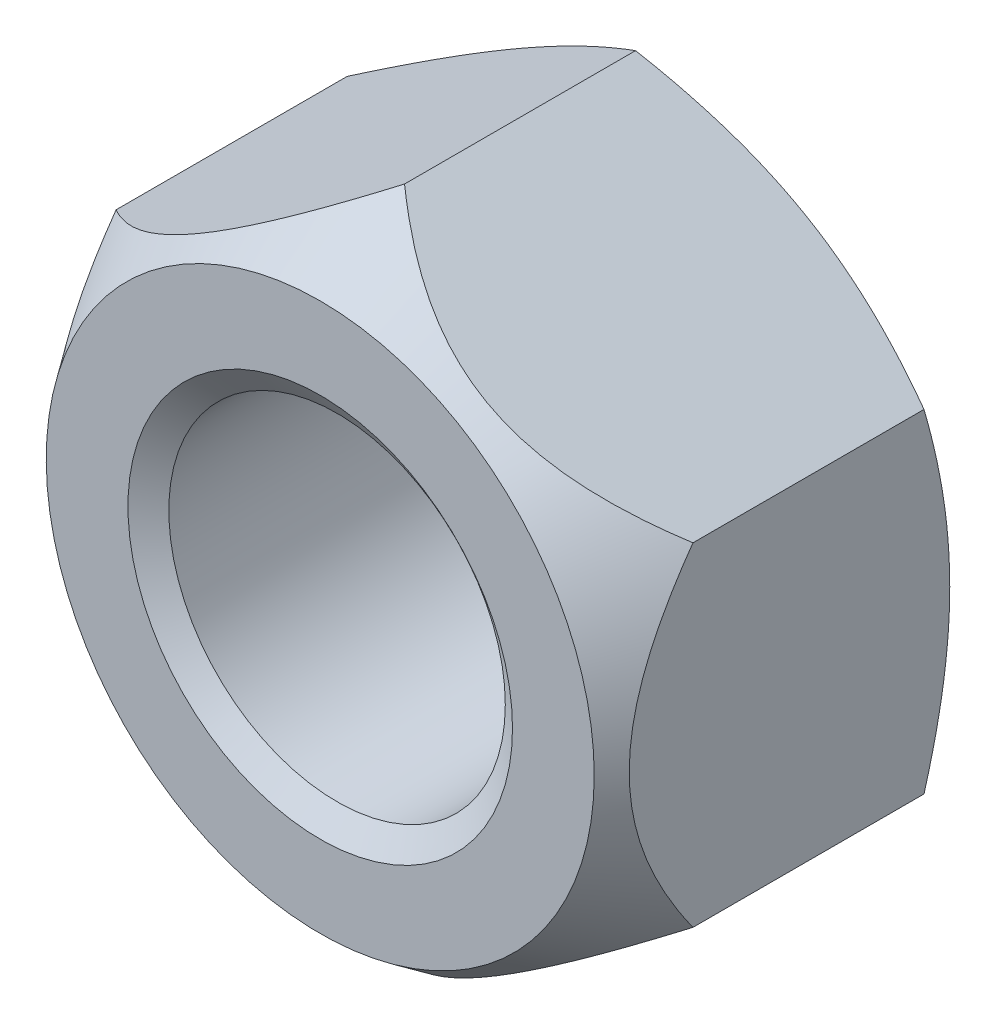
ISO-10303-21;
HEADER;
FILE_DESCRIPTION(('STEP AP214'),'2;1');
FILE_NAME('part.step','',(''),(''),'','','');
FILE_SCHEMA(('AUTOMOTIVE_DESIGN { 1 0 10303 214 1 1 1 1 }'));
ENDSEC;
DATA;
#1=APPLICATION_CONTEXT('core data for automotive mechanical design processes');
#2=APPLICATION_PROTOCOL_DEFINITION('international standard','automotive_design',2000,#1);
#3=PRODUCT_CONTEXT('',#1,'mechanical');
#4=PRODUCT('Part','Part','',(#3));
#5=PRODUCT_RELATED_PRODUCT_CATEGORY('part','',(#4));
#6=PRODUCT_DEFINITION_FORMATION('','',#4);
#7=PRODUCT_DEFINITION_CONTEXT('part definition',#1,'design');
#8=PRODUCT_DEFINITION('design','',#6,#7);
#9=PRODUCT_DEFINITION_SHAPE('','',#8);
#10=(LENGTH_UNIT() NAMED_UNIT(*) SI_UNIT(.MILLI.,.METRE.));
#11=(NAMED_UNIT(*) PLANE_ANGLE_UNIT() SI_UNIT($,.RADIAN.));
#12=(NAMED_UNIT(*) SI_UNIT($,.STERADIAN.) SOLID_ANGLE_UNIT());
#13=UNCERTAINTY_MEASURE_WITH_UNIT(LENGTH_MEASURE(1.E-05),#10,'distance_accuracy_value','');
#14=(GEOMETRIC_REPRESENTATION_CONTEXT(3) GLOBAL_UNCERTAINTY_ASSIGNED_CONTEXT((#13)) GLOBAL_UNIT_ASSIGNED_CONTEXT((#10,
#11,#12)) REPRESENTATION_CONTEXT('',''));
#15=CARTESIAN_POINT('',(0.,0.,0.));
#16=DIRECTION('',(0.,0.,1.));
#17=DIRECTION('',(1.,0.,0.));
#18=AXIS2_PLACEMENT_3D('',#15,#16,#17);
#19=CARTESIAN_POINT('',(0.,0.,-22.5298));
#20=DIRECTION('',(0.,0.,1.));
#21=DIRECTION('',(1.,0.,0.));
#22=AXIS2_PLACEMENT_3D('',#19,#20,#21);
#23=CYLINDRICAL_SURFACE('',#22,11.1125);
#24=CARTESIAN_POINT('',(0.,0.,-1.11157946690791));
#25=DIRECTION('',(0.,0.,1.));
#26=DIRECTION('',(1.,0.,0.));
#27=AXIS2_PLACEMENT_3D('',#24,#25,#26);
#28=CIRCLE('',#27,11.1125);
#29=CARTESIAN_POINT('',(11.1125,0.,-1.11157946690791));
#30=VERTEX_POINT('',#29);
#31=EDGE_CURVE('E152',#30,#30,#28,.F.);
#32=ORIENTED_EDGE('',*,*,#31,.F.);
#33=EDGE_LOOP('',(#32));
#34=FACE_BOUND('',#33,.T.);
#35=CARTESIAN_POINT('',(0.,0.,-21.3928205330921));
#36=DIRECTION('',(0.,0.,-1.));
#37=DIRECTION('',(-1.,0.,0.));
#38=AXIS2_PLACEMENT_3D('',#35,#36,#37);
#39=CIRCLE('',#38,11.1125);
#40=CARTESIAN_POINT('',(-11.1125,0.,-21.3928205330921));
#41=VERTEX_POINT('',#40);
#42=EDGE_CURVE('E46',#41,#41,#39,.F.);
#43=ORIENTED_EDGE('',*,*,#42,.F.);
#44=EDGE_LOOP('',(#43));
#45=FACE_BOUND('',#44,.T.);
#46=ADVANCED_FACE('F41',(#34,#45),#23,.F.);
#47=CARTESIAN_POINT('',(0.,21.9970452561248,-22.5298));
#48=DIRECTION('',(-0.500000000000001,0.866025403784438,0.));
#49=DIRECTION('',(-0.866025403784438,-0.500000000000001,0.));
#50=AXIS2_PLACEMENT_3D('',#47,#48,#49);
#51=PLANE('',#50);
#52=DIRECTION('',(0.,0.,1.));
#53=VECTOR('',#52,1.);
#54=CARTESIAN_POINT('',(-19.05,10.9985226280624,-22.5298));
#55=LINE('',#54,#53);
#56=CARTESIAN_POINT('',(-19.05,10.9985226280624,-20.8283226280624));
#57=VERTEX_POINT('',#56);
#58=CARTESIAN_POINT('',(-19.05,10.9985226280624,-5.56912778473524));
#59=VERTEX_POINT('',#58);
#60=EDGE_CURVE('E150',#57,#59,#55,.T.);
#61=ORIENTED_EDGE('',*,*,#60,.T.);
#62=CARTESIAN_POINT('',(-19.0502,10.9984071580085,-5.56929269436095));
#63=CARTESIAN_POINT('',(-18.8453662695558,11.1166679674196,-5.40041245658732));
#64=CARTESIAN_POINT('',(-18.6388597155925,11.2358945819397,-5.23420678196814));
#65=CARTESIAN_POINT('',(-18.2222319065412,11.4764347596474,-4.90783687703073));
#66=CARTESIAN_POINT('',(-18.0121098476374,11.5977487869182,-4.74767401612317));
#67=CARTESIAN_POINT('',(-17.5873475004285,11.8429854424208,-4.43362161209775));
#68=CARTESIAN_POINT('',(-17.3726941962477,11.9669155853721,-4.27975544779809));
#69=CARTESIAN_POINT('',(-16.9393892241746,12.2170843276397,-3.97977623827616));
#70=CARTESIAN_POINT('',(-16.7207377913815,12.3433227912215,-3.83366273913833));
#71=CARTESIAN_POINT('',(-16.0490977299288,12.7310943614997,-3.40234297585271));
#72=CARTESIAN_POINT('',(-15.5893666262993,12.9965202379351,-3.13087151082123));
#73=CARTESIAN_POINT('',(-14.6519085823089,13.5377618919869,-2.63436725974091));
#74=CARTESIAN_POINT('',(-14.1742069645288,13.8135630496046,-2.40927182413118));
#75=CARTESIAN_POINT('',(-13.3558001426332,14.2860704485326,-2.07908042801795));
#76=CARTESIAN_POINT('',(-13.019758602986,14.4800841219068,-1.95857631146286));
#77=CARTESIAN_POINT('',(-12.340467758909,14.8722728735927,-1.74816439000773));
#78=CARTESIAN_POINT('',(-11.99721829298,15.070448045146,-1.65825727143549));
#79=CARTESIAN_POINT('',(-11.3086235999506,15.4680083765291,-1.51311138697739));
#80=CARTESIAN_POINT('',(-10.9633302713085,15.66736357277,-1.45754754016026));
#81=CARTESIAN_POINT('',(-10.2698215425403,16.0677610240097,-1.3820479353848));
#82=CARTESIAN_POINT('',(-9.92160634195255,16.2688031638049,-1.36210976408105));
#83=CARTESIAN_POINT('',(-9.22408989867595,16.6715144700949,-1.35874101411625));
#84=CARTESIAN_POINT('',(-8.87478828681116,16.8731838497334,-1.37541027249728));
#85=CARTESIAN_POINT('',(-8.17888171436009,17.2749656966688,-1.44471206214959));
#86=CARTESIAN_POINT('',(-7.83227694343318,17.4750780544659,-1.49734710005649));
#87=CARTESIAN_POINT('',(-7.1408722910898,17.8742607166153,-1.63704406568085));
#88=CARTESIAN_POINT('',(-6.79612309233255,18.0733017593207,-1.72443718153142));
#89=CARTESIAN_POINT('',(-6.11375792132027,18.4672654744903,-1.93029611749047));
#90=CARTESIAN_POINT('',(-5.7761417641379,18.6621882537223,-2.04876113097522));
#91=CARTESIAN_POINT('',(-4.94843128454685,19.1400671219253,-2.3766360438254));
#92=CARTESIAN_POINT('',(-4.4631867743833,19.420223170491,-2.60237146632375));
#93=CARTESIAN_POINT('',(-3.51113232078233,19.9698920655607,-3.10192210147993));
#94=CARTESIAN_POINT('',(-3.04435009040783,20.2393889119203,-3.37580646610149));
#95=CARTESIAN_POINT('',(-2.36261308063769,20.6329899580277,-3.81165608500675));
#96=CARTESIAN_POINT('',(-2.14070890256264,20.7611063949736,-3.959408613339));
#97=CARTESIAN_POINT('',(-1.70101851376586,21.0149617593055,-4.26292347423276));
#98=CARTESIAN_POINT('',(-1.48323255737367,21.1407005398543,-4.41868629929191));
#99=CARTESIAN_POINT('',(-1.05237037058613,21.3894589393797,-4.73670985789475));
#100=CARTESIAN_POINT('',(-0.83927998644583,21.5124867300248,-4.898945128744));
#101=CARTESIAN_POINT('',(-0.41682059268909,21.7563937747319,-5.22963625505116));
#102=CARTESIAN_POINT('',(-0.2074507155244,21.8772735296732,-5.39809063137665));
#103=CARTESIAN_POINT('',(0.000199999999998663,21.9971607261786,-5.56929269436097));
#104=B_SPLINE_CURVE_WITH_KNOTS('',3,(#62,#63,#64,#65,#66,#67,#68,#69,#70,#71,#72,#73,#74,#75,
#76,#77,#78,#79,#80,#81,#82,#83,#84,#85,#86,#87,#88,#89,#90,#91,#92,#93,#94,#95,#96,#97,#98,#99,
#100,#101,#102,#103),.UNSPECIFIED.,.F.,.F.,(4,2,2,2,2,2,2,2,2,2,2,2,2,2,2,2,2,2,2,2,4),(0.,
0.871882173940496,1.74396075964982,2.6190278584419,3.49404366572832,5.28095650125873,
7.06543932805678,8.28329825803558,9.50118450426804,10.7073586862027,11.9134511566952,
13.1228370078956,14.3323071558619,15.5535888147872,16.7748387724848,18.5840806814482,
20.3959425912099,21.2831693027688,22.1704506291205,23.0545317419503,23.9384039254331),.UNSPECIFIED.);
#105=CARTESIAN_POINT('',(0.,21.9970452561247,-5.56912778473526));
#106=VERTEX_POINT('',#105);
#107=EDGE_CURVE('E58',#59,#106,#104,.T.);
#108=ORIENTED_EDGE('',*,*,#107,.T.);
#109=DIRECTION('',(0.,0.,1.));
#110=VECTOR('',#109,1.);
#111=CARTESIAN_POINT('',(0.,21.9970452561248,-22.5298));
#112=LINE('',#111,#110);
#113=CARTESIAN_POINT('',(0.,21.9970452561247,-20.8283226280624));
#114=VERTEX_POINT('',#113);
#115=EDGE_CURVE('E131',#114,#106,#112,.T.);
#116=ORIENTED_EDGE('',*,*,#115,.F.);
#117=CARTESIAN_POINT('',(-19.0502,10.9984071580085,-20.8282559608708));
#118=CARTESIAN_POINT('',(-18.6314889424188,11.2401500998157,-20.9678165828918));
#119=CARTESIAN_POINT('',(-18.2111446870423,11.4828359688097,-21.1010441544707));
#120=CARTESIAN_POINT('',(-17.3670855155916,11.9701537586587,-21.3530728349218));
#121=CARTESIAN_POINT('',(-16.9433695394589,12.2147862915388,-21.4718691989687));
#122=CARTESIAN_POINT('',(-16.0917480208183,12.7064702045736,-21.6934385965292));
#123=CARTESIAN_POINT('',(-15.6638350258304,12.9535258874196,-21.7961737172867));
#124=CARTESIAN_POINT('',(-14.8050356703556,13.4493539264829,-21.9834145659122));
#125=CARTESIAN_POINT('',(-14.374149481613,13.6981261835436,-22.0679213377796));
#126=CARTESIAN_POINT('',(-13.5204444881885,14.1910129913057,-22.2151111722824));
#127=CARTESIAN_POINT('',(-13.0976890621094,14.4350909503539,-22.2782814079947));
#128=CARTESIAN_POINT('',(-12.250241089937,14.9243652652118,-22.3842036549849));
#129=CARTESIAN_POINT('',(-11.8255485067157,15.1695616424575,-22.4269552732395));
#130=CARTESIAN_POINT('',(-10.9754499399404,15.6603662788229,-22.4909608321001));
#131=CARTESIAN_POINT('',(-10.5500454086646,15.9059736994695,-22.5122403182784));
#132=CARTESIAN_POINT('',(-9.6988436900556,16.397415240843,-22.532843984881));
#133=CARTESIAN_POINT('',(-9.27304651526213,16.6432493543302,-22.5321688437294));
#134=CARTESIAN_POINT('',(-8.47700964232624,17.1028414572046,-22.5103966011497));
#135=CARTESIAN_POINT('',(-8.10671322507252,17.316632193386,-22.4919544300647));
#136=CARTESIAN_POINT('',(-7.3670036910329,17.7437036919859,-22.4388155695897));
#137=CARTESIAN_POINT('',(-6.99759056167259,17.9569844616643,-22.4041191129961));
#138=CARTESIAN_POINT('',(-6.25978756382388,18.3829552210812,-22.3190737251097));
#139=CARTESIAN_POINT('',(-5.89139892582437,18.5956445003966,-22.2687106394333));
#140=CARTESIAN_POINT('',(-5.15637533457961,19.0200105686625,-22.1532206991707));
#141=CARTESIAN_POINT('',(-4.7897403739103,19.2316873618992,-22.0880939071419));
#142=CARTESIAN_POINT('',(-3.67677271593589,19.8742595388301,-21.8689116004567));
#143=CARTESIAN_POINT('',(-2.93366305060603,20.3032941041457,-21.6930008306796));
#144=CARTESIAN_POINT('',(-1.45852420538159,21.1549659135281,-21.2937556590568));
#145=CARTESIAN_POINT('',(-0.726476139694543,21.5776140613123,-21.0705150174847));
#146=CARTESIAN_POINT('',(0.000199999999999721,21.9971607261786,-20.8282559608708));
#147=B_SPLINE_CURVE_WITH_KNOTS('',3,(#117,#118,#119,#120,#121,#122,#123,#124,#125,#126,#127,
#128,#129,#130,#131,#132,#133,#134,#135,#136,#137,#138,#139,#140,#141,#142,#143,#144,#145,#146),
.UNSPECIFIED.,.F.,.F.,(4,2,2,2,2,2,2,2,2,2,2,2,2,2,4),(0.,1.50971559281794,3.01992622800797,
4.53364959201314,6.04728623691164,7.52356313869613,8.99986845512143,10.4744153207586,
11.9489166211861,13.2325441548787,14.5161533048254,15.8009255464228,17.085692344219,
19.7118183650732,22.3327898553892),.UNSPECIFIED.);
#148=CARTESIAN_POINT('',(-9.52500000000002,16.4977839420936,-22.5298));
#149=VERTEX_POINT('',#148);
#150=EDGE_CURVE('E151',#149,#114,#147,.T.);
#151=ORIENTED_EDGE('',*,*,#150,.F.);
#152=EDGE_CURVE('E237',#57,#149,#147,.T.);
#153=ORIENTED_EDGE('',*,*,#152,.F.);
#154=EDGE_LOOP('',(#61,#108,#116,#151,#153));
#155=FACE_BOUND('',#154,.T.);
#156=ADVANCED_FACE('F43',(#155),#51,.T.);
#157=CARTESIAN_POINT('',(19.05,10.9985226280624,-22.5298));
#158=DIRECTION('',(0.500000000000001,0.866025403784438,0.));
#159=DIRECTION('',(-0.866025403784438,0.500000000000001,0.));
#160=AXIS2_PLACEMENT_3D('',#157,#158,#159);
#161=PLANE('',#160);
#162=ORIENTED_EDGE('',*,*,#115,.T.);
#163=CARTESIAN_POINT('',(-0.000200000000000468,21.9971607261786,-5.56929269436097));
#164=CARTESIAN_POINT('',(0.204633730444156,21.8788999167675,-5.40041245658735));
#165=CARTESIAN_POINT('',(0.411140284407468,21.7596733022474,-5.23420678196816));
#166=CARTESIAN_POINT('',(0.827768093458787,21.5191331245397,-4.90783687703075));
#167=CARTESIAN_POINT('',(1.03789015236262,21.3978190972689,-4.7476740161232));
#168=CARTESIAN_POINT('',(1.46265249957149,21.1525824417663,-4.43362161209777));
#169=CARTESIAN_POINT('',(1.67730580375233,21.028652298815,-4.27975544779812));
#170=CARTESIAN_POINT('',(2.11061077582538,20.7784835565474,-3.97977623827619));
#171=CARTESIAN_POINT('',(2.32926220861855,20.6522450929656,-3.83366273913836));
#172=CARTESIAN_POINT('',(3.00090227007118,20.2644735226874,-3.40234297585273));
#173=CARTESIAN_POINT('',(3.4606333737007,19.999047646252,-3.13087151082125));
#174=CARTESIAN_POINT('',(4.39809141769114,19.4578059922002,-2.63436725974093));
#175=CARTESIAN_POINT('',(4.87579303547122,19.1820048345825,-2.4092718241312));
#176=CARTESIAN_POINT('',(5.69419985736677,18.7094974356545,-2.07908042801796));
#177=CARTESIAN_POINT('',(6.03024139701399,18.5154837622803,-1.95857631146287));
#178=CARTESIAN_POINT('',(6.70953224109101,18.1232950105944,-1.74816439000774));
#179=CARTESIAN_POINT('',(7.05278170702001,17.9251198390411,-1.6582572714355));
#180=CARTESIAN_POINT('',(7.74137640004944,17.527559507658,-1.5131113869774));
#181=CARTESIAN_POINT('',(8.08666972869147,17.3282043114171,-1.45754754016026));
#182=CARTESIAN_POINT('',(8.78017845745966,16.9278068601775,-1.38204793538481));
#183=CARTESIAN_POINT('',(9.12839365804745,16.7267647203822,-1.36210976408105));
#184=CARTESIAN_POINT('',(9.82591010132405,16.3240534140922,-1.35874101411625));
#185=CARTESIAN_POINT('',(10.1752117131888,16.1223840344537,-1.37541027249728));
#186=CARTESIAN_POINT('',(10.8711182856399,15.7206021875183,-1.44471206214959));
#187=CARTESIAN_POINT('',(11.2177230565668,15.5204898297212,-1.49734710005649));
#188=CARTESIAN_POINT('',(11.9091277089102,15.1213071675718,-1.63704406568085));
#189=CARTESIAN_POINT('',(12.2538769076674,14.9222661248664,-1.72443718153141));
#190=CARTESIAN_POINT('',(12.9362420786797,14.5283024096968,-1.93029611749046));
#191=CARTESIAN_POINT('',(13.2738582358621,14.3333796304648,-2.0487611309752));
#192=CARTESIAN_POINT('',(14.1015687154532,13.8555007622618,-2.37663604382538));
#193=CARTESIAN_POINT('',(14.5868132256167,13.5753447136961,-2.60237146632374));
#194=CARTESIAN_POINT('',(15.5388676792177,13.0256758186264,-3.10192210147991));
#195=CARTESIAN_POINT('',(16.0056499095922,12.7561789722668,-3.37580646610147));
#196=CARTESIAN_POINT('',(16.6873869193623,12.3625779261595,-3.81165608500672));
#197=CARTESIAN_POINT('',(16.9092910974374,12.2344614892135,-3.95940861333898));
#198=CARTESIAN_POINT('',(17.3489814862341,11.9806061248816,-4.26292347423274));
#199=CARTESIAN_POINT('',(17.5667674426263,11.8548673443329,-4.41868629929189));
#200=CARTESIAN_POINT('',(17.9976296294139,11.6061089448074,-4.73670985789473));
#201=CARTESIAN_POINT('',(18.2107200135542,11.4830811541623,-4.89894512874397));
#202=CARTESIAN_POINT('',(18.6331794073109,11.2391741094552,-5.22963625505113));
#203=CARTESIAN_POINT('',(18.8425492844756,11.1182943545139,-5.39809063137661));
#204=CARTESIAN_POINT('',(19.0502,10.9984071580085,-5.56929269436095));
#205=B_SPLINE_CURVE_WITH_KNOTS('',3,(#163,#164,#165,#166,#167,#168,#169,#170,#171,#172,#173,
#174,#175,#176,#177,#178,#179,#180,#181,#182,#183,#184,#185,#186,#187,#188,#189,#190,#191,#192,
#193,#194,#195,#196,#197,#198,#199,#200,#201,#202,#203,#204),.UNSPECIFIED.,.F.,.F.,(4,2,2,2,2,2,
2,2,2,2,2,2,2,2,2,2,2,2,2,2,4),(0.,0.871882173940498,1.74396075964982,2.61902785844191,
3.49404366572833,5.28095650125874,7.06543932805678,8.28329825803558,9.50118450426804,
10.7073586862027,11.9134511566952,13.1228370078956,14.3323071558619,15.5535888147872,
16.7748387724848,18.5840806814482,20.3959425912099,21.2831693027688,22.1704506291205,
23.0545317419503,23.9384039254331),.UNSPECIFIED.);
#206=CARTESIAN_POINT('',(19.05,10.9985226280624,-5.56912778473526));
#207=VERTEX_POINT('',#206);
#208=EDGE_CURVE('E114',#106,#207,#205,.T.);
#209=ORIENTED_EDGE('',*,*,#208,.T.);
#210=DIRECTION('',(0.,0.,1.));
#211=VECTOR('',#210,1.);
#212=CARTESIAN_POINT('',(19.05,10.9985226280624,-22.5298));
#213=LINE('',#212,#211);
#214=CARTESIAN_POINT('',(19.05,10.9985226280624,-20.8283226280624));
#215=VERTEX_POINT('',#214);
#216=EDGE_CURVE('E127',#215,#207,#213,.T.);
#217=ORIENTED_EDGE('',*,*,#216,.F.);
#218=CARTESIAN_POINT('',(-0.000200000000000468,21.9971607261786,-20.8282559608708));
#219=CARTESIAN_POINT('',(0.418511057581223,21.7554177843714,-20.9678165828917));
#220=CARTESIAN_POINT('',(0.83885531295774,21.5127319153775,-21.1010441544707));
#221=CARTESIAN_POINT('',(1.68291448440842,21.0254141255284,-21.3530728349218));
#222=CARTESIAN_POINT('',(2.10663046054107,20.7807815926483,-21.4718691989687));
#223=CARTESIAN_POINT('',(2.95825197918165,20.2890976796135,-21.6934385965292));
#224=CARTESIAN_POINT('',(3.38616497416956,20.0420419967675,-21.7961737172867));
#225=CARTESIAN_POINT('',(4.24496432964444,19.5462139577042,-21.9834145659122));
#226=CARTESIAN_POINT('',(4.67585051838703,19.2974417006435,-22.0679213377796));
#227=CARTESIAN_POINT('',(5.52955551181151,18.8045548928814,-22.2151111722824));
#228=CARTESIAN_POINT('',(5.95231093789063,18.5604769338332,-22.2782814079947));
#229=CARTESIAN_POINT('',(6.79975891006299,18.0712026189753,-22.3842036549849));
#230=CARTESIAN_POINT('',(7.22445149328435,17.8260062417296,-22.4269552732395));
#231=CARTESIAN_POINT('',(8.07455006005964,17.3352016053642,-22.4909608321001));
#232=CARTESIAN_POINT('',(8.49995459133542,17.0895941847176,-22.5122403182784));
#233=CARTESIAN_POINT('',(9.35115630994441,16.5981526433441,-22.532843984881));
#234=CARTESIAN_POINT('',(9.77695348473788,16.3523185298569,-22.5321688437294));
#235=CARTESIAN_POINT('',(10.5729903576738,15.8927264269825,-22.5103966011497));
#236=CARTESIAN_POINT('',(10.9432867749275,15.6789356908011,-22.4919544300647));
#237=CARTESIAN_POINT('',(11.6829963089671,15.2518641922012,-22.4388155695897));
#238=CARTESIAN_POINT('',(12.0524094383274,15.0385834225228,-22.4041191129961));
#239=CARTESIAN_POINT('',(12.7902124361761,14.6126126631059,-22.3190737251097));
#240=CARTESIAN_POINT('',(13.1586010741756,14.3999233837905,-22.2687106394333));
#241=CARTESIAN_POINT('',(13.8936246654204,13.9755573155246,-22.1532206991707));
#242=CARTESIAN_POINT('',(14.2602596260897,13.7638805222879,-22.0880939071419));
#243=CARTESIAN_POINT('',(15.3732272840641,13.121308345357,-21.8689116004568));
#244=CARTESIAN_POINT('',(16.116336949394,12.6922737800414,-21.6930008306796));
#245=CARTESIAN_POINT('',(17.5914757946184,11.840601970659,-21.2937556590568));
#246=CARTESIAN_POINT('',(18.3235238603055,11.4179538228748,-21.0705150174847));
#247=CARTESIAN_POINT('',(19.0502,10.9984071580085,-20.8282559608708));
#248=B_SPLINE_CURVE_WITH_KNOTS('',3,(#218,#219,#220,#221,#222,#223,#224,#225,#226,#227,#228,
#229,#230,#231,#232,#233,#234,#235,#236,#237,#238,#239,#240,#241,#242,#243,#244,#245,#246,#247),
.UNSPECIFIED.,.F.,.F.,(4,2,2,2,2,2,2,2,2,2,2,2,2,2,4),(0.,1.50971559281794,3.01992622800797,
4.53364959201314,6.04728623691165,7.52356313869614,8.99986845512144,10.4744153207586,
11.9489166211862,13.2325441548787,14.5161533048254,15.8009255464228,17.085692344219,
19.7118183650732,22.3327898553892),.UNSPECIFIED.);
#249=CARTESIAN_POINT('',(9.52500000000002,16.4977839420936,-22.5298));
#250=VERTEX_POINT('',#249);
#251=EDGE_CURVE('E235',#250,#215,#248,.T.);
#252=ORIENTED_EDGE('',*,*,#251,.F.);
#253=EDGE_CURVE('E238',#114,#250,#248,.T.);
#254=ORIENTED_EDGE('',*,*,#253,.F.);
#255=EDGE_LOOP('',(#162,#209,#217,#252,#254));
#256=FACE_BOUND('',#255,.T.);
#257=ADVANCED_FACE('F128',(#256),#161,.T.);
#258=CARTESIAN_POINT('',(19.05,10.9985226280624,-22.5298));
#259=DIRECTION('',(-1.,0.,0.));
#260=DIRECTION('',(0.,0.,1.));
#261=AXIS2_PLACEMENT_3D('',#258,#259,#260);
#262=PLANE('',#261);
#263=CARTESIAN_POINT('',(19.05,-19.3743103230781,-12.9583839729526));
#264=CARTESIAN_POINT('',(19.05,-19.1650093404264,-12.745247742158));
#265=CARTESIAN_POINT('',(19.05,-18.9548636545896,-12.5329417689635));
#266=CARTESIAN_POINT('',(19.05,-18.5327532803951,-12.1101384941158));
#267=CARTESIAN_POINT('',(19.05,-18.3207885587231,-11.8996412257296));
#268=CARTESIAN_POINT('',(19.05,-17.6818808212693,-11.2709958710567));
#269=CARTESIAN_POINT('',(19.05,-17.2520245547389,-10.8557966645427));
#270=CARTESIAN_POINT('',(19.05,-16.3797345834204,-10.0313290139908));
#271=CARTESIAN_POINT('',(19.05,-15.9372252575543,-9.62214041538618));
#272=CARTESIAN_POINT('',(19.05,-15.0417851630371,-8.81536758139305));
#273=CARTESIAN_POINT('',(19.05,-14.5888552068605,-8.41778244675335));
#274=CARTESIAN_POINT('',(19.05,-13.6369179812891,-7.60786472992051));
#275=CARTESIAN_POINT('',(19.05,-13.1369816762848,-7.19661894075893));
#276=CARTESIAN_POINT('',(19.05,-12.1206716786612,-6.39462994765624));
#277=CARTESIAN_POINT('',(19.05,-11.6042947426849,-6.00389082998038));
#278=CARTESIAN_POINT('',(19.05,-10.5542748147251,-5.2500220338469));
#279=CARTESIAN_POINT('',(19.05,-10.0206959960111,-4.88680360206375));
#280=CARTESIAN_POINT('',(19.05,-8.93207813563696,-4.19436554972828));
#281=CARTESIAN_POINT('',(19.05,-8.37705094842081,-3.8651275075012));
#282=CARTESIAN_POINT('',(19.05,-7.3162878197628,-3.29048622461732));
#283=CARTESIAN_POINT('',(19.05,-6.81346811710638,-3.03974765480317));
#284=CARTESIAN_POINT('',(19.05,-5.78868743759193,-2.58014686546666));
#285=CARTESIAN_POINT('',(19.05,-5.26672238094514,-2.37129363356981));
#286=CARTESIAN_POINT('',(19.05,-4.2134130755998,-2.0084403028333));
#287=CARTESIAN_POINT('',(19.05,-3.68237247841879,-1.85357982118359));
#288=CARTESIAN_POINT('',(19.05,-2.87567886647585,-1.66592596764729));
#289=CARTESIAN_POINT('',(19.05,-2.60511708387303,-1.61081712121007));
#290=CARTESIAN_POINT('',(19.05,-2.0612652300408,-1.51639726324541));
#291=CARTESIAN_POINT('',(19.05,-1.78797548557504,-1.47708438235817));
#292=CARTESIAN_POINT('',(19.05,-1.1191648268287,-1.40143969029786));
#293=CARTESIAN_POINT('',(19.05,-0.722600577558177,-1.37397624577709));
#294=CARTESIAN_POINT('',(19.05,0.0713035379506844,-1.35459529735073));
#295=CARTESIAN_POINT('',(19.05,0.468643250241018,-1.36267133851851));
#296=CARTESIAN_POINT('',(19.05,1.26182970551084,-1.41404559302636));
#297=CARTESIAN_POINT('',(19.05,1.65767182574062,-1.45741475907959));
#298=CARTESIAN_POINT('',(19.05,2.44423024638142,-1.57764574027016));
#299=CARTESIAN_POINT('',(19.05,2.83494557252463,-1.65451382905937));
#300=CARTESIAN_POINT('',(19.05,3.7282346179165,-1.86727472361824));
#301=CARTESIAN_POINT('',(19.05,4.22821884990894,-2.01405304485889));
#302=CARTESIAN_POINT('',(19.05,5.21280896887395,-2.35222295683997));
#303=CARTESIAN_POINT('',(19.05,5.69740794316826,-2.54363428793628));
#304=CARTESIAN_POINT('',(19.05,6.65539188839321,-2.96542671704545));
#305=CARTESIAN_POINT('',(19.05,7.12860174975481,-3.19620229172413));
#306=CARTESIAN_POINT('',(19.05,7.82611954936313,-3.56506711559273));
#307=CARTESIAN_POINT('',(19.05,8.05655385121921,-3.69179200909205));
#308=CARTESIAN_POINT('',(19.05,8.51353807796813,-3.95208128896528));
#309=CARTESIAN_POINT('',(19.05,8.74008795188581,-4.08564576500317));
#310=CARTESIAN_POINT('',(19.05,9.30210669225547,-4.42740953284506));
#311=CARTESIAN_POINT('',(19.05,9.63523728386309,-4.63945476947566));
#312=CARTESIAN_POINT('',(19.05,10.293726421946,-5.0753325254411));
#313=CARTESIAN_POINT('',(19.05,10.6190838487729,-5.29916672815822));
#314=CARTESIAN_POINT('',(19.05,11.2627927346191,-5.75701156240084));
#315=CARTESIAN_POINT('',(19.05,11.5811404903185,-5.99102738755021));
#316=CARTESIAN_POINT('',(19.05,12.211302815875,-6.46771928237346));
#317=CARTESIAN_POINT('',(19.05,12.5231169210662,-6.71039596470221));
#318=CARTESIAN_POINT('',(19.05,13.141936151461,-7.20412940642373));
#319=CARTESIAN_POINT('',(19.05,13.4489189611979,-7.45521408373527));
#320=CARTESIAN_POINT('',(19.05,14.0574337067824,-7.96391298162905));
#321=CARTESIAN_POINT('',(19.05,14.3589654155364,-8.22152747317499));
#322=CARTESIAN_POINT('',(19.05,15.2559576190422,-9.0027074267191));
#323=CARTESIAN_POINT('',(19.05,15.8440233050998,-9.53477717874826));
#324=CARTESIAN_POINT('',(19.05,16.9655163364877,-10.5806392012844));
#325=CARTESIAN_POINT('',(19.05,17.499988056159,-11.0933197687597));
#326=CARTESIAN_POINT('',(19.05,18.5569815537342,-12.130926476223));
#327=CARTESIAN_POINT('',(19.05,19.0795022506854,-12.6558537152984));
#328=CARTESIAN_POINT('',(19.05,20.1097019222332,-13.7108246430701));
#329=CARTESIAN_POINT('',(19.05,20.6174723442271,-14.2407792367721));
#330=CARTESIAN_POINT('',(19.05,21.372663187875,-15.041669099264));
#331=CARTESIAN_POINT('',(19.05,21.6232873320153,-15.3095939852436));
#332=CARTESIAN_POINT('',(19.05,22.1225507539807,-15.8472796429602));
#333=CARTESIAN_POINT('',(19.05,22.3711900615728,-16.117040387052));
#334=CARTESIAN_POINT('',(19.05,22.6189155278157,-16.3876381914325));
#335=B_SPLINE_CURVE_WITH_KNOTS('',3,(#263,#264,#265,#266,#267,#268,#269,#270,#271,#272,#273,
#274,#275,#276,#277,#278,#279,#280,#281,#282,#283,#284,#285,#286,#287,#288,#289,#290,#291,#292,
#293,#294,#295,#296,#297,#298,#299,#300,#301,#302,#303,#304,#305,#306,#307,#308,#309,#310,#311,
#312,#313,#314,#315,#316,#317,#318,#319,#320,#321,#322,#323,#324,#325,#326,#327,#328,#329,#330,
#331,#332,#333,#334),.UNSPECIFIED.,.F.,.F.,(4,2,2,2,2,2,2,2,2,2,2,2,2,2,2,2,2,2,2,2,2,2,2,2,2,2,
2,2,2,2,2,2,2,2,2,4),(0.,0.896157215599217,1.79233087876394,3.58510826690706,5.39304628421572,
7.20084381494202,9.1424563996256,11.0844544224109,13.0198964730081,14.9542836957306,
16.6383417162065,18.3227607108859,19.9789590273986,20.8069087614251,21.6347604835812,
22.8256693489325,24.0163619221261,25.2094541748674,26.4027699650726,27.9634143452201,
29.5247502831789,31.1027663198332,31.8916186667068,32.6804813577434,33.8648476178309,
35.0493834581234,36.2345307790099,37.4197621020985,38.6094209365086,39.799129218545,
42.1777443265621,44.3993561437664,46.6211681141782,48.8229033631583,49.9235159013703,
51.0241119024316),.UNSPECIFIED.);
#336=CARTESIAN_POINT('',(19.05,-10.9985226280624,-5.56912778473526));
#337=VERTEX_POINT('',#336);
#338=EDGE_CURVE('E115',#337,#207,#335,.T.);
#339=ORIENTED_EDGE('',*,*,#338,.F.);
#340=DIRECTION('',(0.,0.,1.));
#341=VECTOR('',#340,1.);
#342=CARTESIAN_POINT('',(19.05,-10.9985226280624,-22.5298));
#343=LINE('',#342,#341);
#344=CARTESIAN_POINT('',(19.05,-10.9985226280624,-20.8283226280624));
#345=VERTEX_POINT('',#344);
#346=EDGE_CURVE('E139',#345,#337,#343,.T.);
#347=ORIENTED_EDGE('',*,*,#346,.F.);
#348=CARTESIAN_POINT('',(19.05,-29.169702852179,-13.4138662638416));
#349=CARTESIAN_POINT('',(19.05,-28.7515170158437,-13.6160110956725));
#350=CARTESIAN_POINT('',(19.05,-28.3328257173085,-13.8171097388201));
#351=CARTESIAN_POINT('',(19.05,-27.494325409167,-14.2169745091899));
#352=CARTESIAN_POINT('',(19.05,-27.0745163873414,-14.4157406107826));
#353=CARTESIAN_POINT('',(19.05,-25.813129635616,-15.0082374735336));
#354=CARTESIAN_POINT('',(19.05,-24.9697281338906,-15.3981009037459));
#355=CARTESIAN_POINT('',(19.05,-23.2722707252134,-16.1672287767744));
#356=CARTESIAN_POINT('',(19.05,-22.4181814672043,-16.546419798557));
#357=CARTESIAN_POINT('',(19.05,-20.7029839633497,-17.2885211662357));
#358=CARTESIAN_POINT('',(19.05,-19.8418760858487,-17.6514323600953));
#359=CARTESIAN_POINT('',(19.05,-18.1005821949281,-18.3609430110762));
#360=CARTESIAN_POINT('',(19.05,-17.2202917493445,-18.7072875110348));
#361=CARTESIAN_POINT('',(19.05,-15.4493217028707,-19.3728520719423));
#362=CARTESIAN_POINT('',(19.05,-14.5586409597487,-19.6920691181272));
#363=CARTESIAN_POINT('',(19.05,-12.7673320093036,-20.2947971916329));
#364=CARTESIAN_POINT('',(19.05,-11.8667295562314,-20.5783841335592));
#365=CARTESIAN_POINT('',(19.05,-10.0526343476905,-21.1006560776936));
#366=CARTESIAN_POINT('',(19.05,-9.13914576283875,-21.3393552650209));
#367=CARTESIAN_POINT('',(19.05,-7.7590746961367,-21.6550001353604));
#368=CARTESIAN_POINT('',(19.05,-7.29731333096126,-21.7531639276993));
#369=CARTESIAN_POINT('',(19.05,-6.37071732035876,-21.9338068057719));
#370=CARTESIAN_POINT('',(19.05,-5.90588274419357,-22.0162862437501));
#371=CARTESIAN_POINT('',(19.05,-4.97345228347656,-22.164098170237));
#372=CARTESIAN_POINT('',(19.05,-4.50585623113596,-22.2294296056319));
#373=CARTESIAN_POINT('',(19.05,-3.56843861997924,-22.3416333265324));
#374=CARTESIAN_POINT('',(19.05,-3.09861705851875,-22.388505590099));
#375=CARTESIAN_POINT('',(19.05,-2.16041609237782,-22.4625291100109));
#376=CARTESIAN_POINT('',(19.05,-1.69204648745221,-22.4898037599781));
#377=CARTESIAN_POINT('',(19.05,-0.754574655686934,-22.5244886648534));
#378=CARTESIAN_POINT('',(19.05,-0.285472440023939,-22.5318992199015));
#379=CARTESIAN_POINT('',(19.05,0.652492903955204,-22.5266801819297));
#380=CARTESIAN_POINT('',(19.05,1.12135606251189,-22.5140561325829));
#381=CARTESIAN_POINT('',(19.05,2.05813737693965,-22.4690817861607));
#382=CARTESIAN_POINT('',(19.05,2.52605549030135,-22.4367306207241));
#383=CARTESIAN_POINT('',(19.05,3.65980250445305,-22.3351199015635));
#384=CARTESIAN_POINT('',(19.05,4.32476458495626,-22.2559962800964));
#385=CARTESIAN_POINT('',(19.05,5.64947952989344,-22.0623146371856));
#386=CARTESIAN_POINT('',(19.05,6.30923160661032,-21.9477513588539));
#387=CARTESIAN_POINT('',(19.05,8.2818238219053,-21.556648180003));
#388=CARTESIAN_POINT('',(19.05,9.58542312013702,-21.2329552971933));
#389=CARTESIAN_POINT('',(19.05,11.5353898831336,-20.6748015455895));
#390=CARTESIAN_POINT('',(19.05,12.191945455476,-20.4739165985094));
#391=CARTESIAN_POINT('',(19.05,13.498713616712,-20.0521176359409));
#392=CARTESIAN_POINT('',(19.05,14.1489256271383,-19.8312018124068));
#393=CARTESIAN_POINT('',(19.05,15.4397656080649,-19.3740482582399));
#394=CARTESIAN_POINT('',(19.05,16.0804269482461,-19.1379039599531));
#395=CARTESIAN_POINT('',(19.05,17.0373840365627,-18.773463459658));
#396=CARTESIAN_POINT('',(19.05,17.3556458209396,-18.650300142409));
#397=CARTESIAN_POINT('',(19.05,17.9909330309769,-18.4008420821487));
#398=CARTESIAN_POINT('',(19.05,18.3079584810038,-18.2745474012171));
#399=CARTESIAN_POINT('',(19.05,18.6244086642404,-18.1468283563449));
#400=B_SPLINE_CURVE_WITH_KNOTS('',3,(#348,#349,#350,#351,#352,#353,#354,#355,#356,#357,#358,
#359,#360,#361,#362,#363,#364,#365,#366,#367,#368,#369,#370,#371,#372,#373,#374,#375,#376,#377,
#378,#379,#380,#381,#382,#383,#384,#385,#386,#387,#388,#389,#390,#391,#392,#393,#394,#395,#396,
#397,#398,#399),.UNSPECIFIED.,.F.,.F.,(4,2,2,2,2,2,2,2,2,2,2,2,2,2,2,2,2,2,2,2,2,2,2,2,2,4),(0.,
1.39343811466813,2.78689152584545,5.57425145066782,8.37756231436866,11.1807269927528,
14.0183059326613,16.856199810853,19.6879407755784,22.5187853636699,23.934802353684,
25.3507875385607,26.766859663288,28.1829334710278,29.5900111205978,30.9970675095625,
32.4037346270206,33.8104636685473,35.8182820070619,37.8263983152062,41.8503661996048,
43.910005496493,45.9698308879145,48.0180400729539,49.0418117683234,50.0655631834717),.UNSPECIFIED.);
#401=CARTESIAN_POINT('',(19.05,0.,-22.5298));
#402=VERTEX_POINT('',#401);
#403=EDGE_CURVE('E244',#345,#402,#400,.T.);
#404=ORIENTED_EDGE('',*,*,#403,.T.);
#405=EDGE_CURVE('E138',#402,#215,#400,.T.);
#406=ORIENTED_EDGE('',*,*,#405,.T.);
#407=ORIENTED_EDGE('',*,*,#216,.T.);
#408=EDGE_LOOP('',(#339,#347,#404,#406,#407));
#409=FACE_BOUND('',#408,.T.);
#410=ADVANCED_FACE('F133',(#409),#262,.F.);
#411=CARTESIAN_POINT('',(0.,-21.9970452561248,-22.5298));
#412=DIRECTION('',(0.500000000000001,-0.866025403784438,0.));
#413=DIRECTION('',(0.866025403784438,0.500000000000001,0.));
#414=AXIS2_PLACEMENT_3D('',#411,#412,#413);
#415=PLANE('',#414);
#416=ORIENTED_EDGE('',*,*,#346,.T.);
#417=CARTESIAN_POINT('',(19.0502,-10.9984071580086,-5.56929269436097));
#418=CARTESIAN_POINT('',(18.8453662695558,-11.1166679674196,-5.40041245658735));
#419=CARTESIAN_POINT('',(18.6388597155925,-11.2358945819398,-5.23420678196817));
#420=CARTESIAN_POINT('',(18.2222319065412,-11.4764347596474,-4.90783687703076));
#421=CARTESIAN_POINT('',(18.0121098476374,-11.5977487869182,-4.7476740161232));
#422=CARTESIAN_POINT('',(17.5873475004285,-11.8429854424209,-4.43362161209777));
#423=CARTESIAN_POINT('',(17.3726941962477,-11.9669155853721,-4.27975544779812));
#424=CARTESIAN_POINT('',(16.9393892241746,-12.2170843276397,-3.97977623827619));
#425=CARTESIAN_POINT('',(16.7207377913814,-12.3433227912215,-3.83366273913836));
#426=CARTESIAN_POINT('',(16.0490977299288,-12.7310943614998,-3.40234297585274));
#427=CARTESIAN_POINT('',(15.5893666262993,-12.9965202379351,-3.13087151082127));
#428=CARTESIAN_POINT('',(14.6519085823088,-13.537761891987,-2.63436725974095));
#429=CARTESIAN_POINT('',(14.1742069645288,-13.8135630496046,-2.40927182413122));
#430=CARTESIAN_POINT('',(13.3558001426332,-14.2860704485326,-2.07908042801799));
#431=CARTESIAN_POINT('',(13.019758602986,-14.4800841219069,-1.9585763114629));
#432=CARTESIAN_POINT('',(12.340467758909,-14.8722728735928,-1.74816439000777));
#433=CARTESIAN_POINT('',(11.99721829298,-15.0704480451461,-1.65825727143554));
#434=CARTESIAN_POINT('',(11.3086235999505,-15.4680083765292,-1.51311138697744));
#435=CARTESIAN_POINT('',(10.9633302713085,-15.66736357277,-1.45754754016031));
#436=CARTESIAN_POINT('',(10.2698215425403,-16.0677610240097,-1.38204793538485));
#437=CARTESIAN_POINT('',(9.92160634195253,-16.268803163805,-1.3621097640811));
#438=CARTESIAN_POINT('',(9.22408989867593,-16.6715144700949,-1.3587410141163));
#439=CARTESIAN_POINT('',(8.87478828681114,-16.8731838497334,-1.37541027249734));
#440=CARTESIAN_POINT('',(8.17888171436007,-17.2749656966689,-1.44471206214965));
#441=CARTESIAN_POINT('',(7.83227694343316,-17.475078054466,-1.49734710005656));
#442=CARTESIAN_POINT('',(7.14087229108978,-17.8742607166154,-1.63704406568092));
#443=CARTESIAN_POINT('',(6.79612309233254,-18.0733017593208,-1.72443718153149));
#444=CARTESIAN_POINT('',(6.11375792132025,-18.4672654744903,-1.93029611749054));
#445=CARTESIAN_POINT('',(5.77614176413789,-18.6621882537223,-2.04876113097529));
#446=CARTESIAN_POINT('',(4.94843128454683,-19.1400671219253,-2.37663604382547));
#447=CARTESIAN_POINT('',(4.46318677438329,-19.420223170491,-2.60237146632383));
#448=CARTESIAN_POINT('',(3.51113232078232,-19.9698920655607,-3.10192210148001));
#449=CARTESIAN_POINT('',(3.04435009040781,-20.2393889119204,-3.37580646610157));
#450=CARTESIAN_POINT('',(2.36261308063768,-20.6329899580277,-3.81165608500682));
#451=CARTESIAN_POINT('',(2.14070890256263,-20.7611063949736,-3.95940861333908));
#452=CARTESIAN_POINT('',(1.70101851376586,-21.0149617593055,-4.26292347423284));
#453=CARTESIAN_POINT('',(1.48323255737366,-21.1407005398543,-4.41868629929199));
#454=CARTESIAN_POINT('',(1.05237037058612,-21.3894589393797,-4.73670985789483));
#455=CARTESIAN_POINT('',(0.839279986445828,-21.5124867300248,-4.89894512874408));
#456=CARTESIAN_POINT('',(0.416820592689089,-21.756393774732,-5.22963625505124));
#457=CARTESIAN_POINT('',(0.207450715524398,-21.8772735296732,-5.39809063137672));
#458=CARTESIAN_POINT('',(-0.000200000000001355,-21.9971607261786,-5.56929269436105));
#459=B_SPLINE_CURVE_WITH_KNOTS('',3,(#417,#418,#419,#420,#421,#422,#423,#424,#425,#426,#427,
#428,#429,#430,#431,#432,#433,#434,#435,#436,#437,#438,#439,#440,#441,#442,#443,#444,#445,#446,
#447,#448,#449,#450,#451,#452,#453,#454,#455,#456,#457,#458),.UNSPECIFIED.,.F.,.F.,(4,2,2,2,2,2,
2,2,2,2,2,2,2,2,2,2,2,2,2,2,4),(0.,0.8718821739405,1.74396075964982,2.61902785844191,
3.49404366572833,5.28095650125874,7.06543932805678,8.28329825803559,9.50118450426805,
10.7073586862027,11.9134511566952,13.1228370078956,14.3323071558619,15.5535888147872,
16.7748387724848,18.5840806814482,20.3959425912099,21.2831693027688,22.1704506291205,
23.0545317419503,23.9384039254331),.UNSPECIFIED.);
#460=CARTESIAN_POINT('',(0.,-21.9970452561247,-5.56912778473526));
#461=VERTEX_POINT('',#460);
#462=EDGE_CURVE('E120',#337,#461,#459,.T.);
#463=ORIENTED_EDGE('',*,*,#462,.T.);
#464=DIRECTION('',(0.,0.,1.));
#465=VECTOR('',#464,1.);
#466=CARTESIAN_POINT('',(0.,-21.9970452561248,-22.5298));
#467=LINE('',#466,#465);
#468=CARTESIAN_POINT('',(0.,-21.9970452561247,-20.8283226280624));
#469=VERTEX_POINT('',#468);
#470=EDGE_CURVE('E136',#469,#461,#467,.T.);
#471=ORIENTED_EDGE('',*,*,#470,.F.);
#472=CARTESIAN_POINT('',(19.0502,-10.9984071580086,-20.8282559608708));
#473=CARTESIAN_POINT('',(18.6314889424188,-11.2401500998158,-20.9678165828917));
#474=CARTESIAN_POINT('',(18.2111446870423,-11.4828359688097,-21.1010441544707));
#475=CARTESIAN_POINT('',(17.3670855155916,-11.9701537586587,-21.3530728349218));
#476=CARTESIAN_POINT('',(16.9433695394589,-12.2147862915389,-21.4718691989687));
#477=CARTESIAN_POINT('',(16.0917480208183,-12.7064702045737,-21.6934385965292));
#478=CARTESIAN_POINT('',(15.6638350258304,-12.9535258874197,-21.7961737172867));
#479=CARTESIAN_POINT('',(14.8050356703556,-13.449353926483,-21.9834145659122));
#480=CARTESIAN_POINT('',(14.374149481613,-13.6981261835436,-22.0679213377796));
#481=CARTESIAN_POINT('',(13.5204444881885,-14.1910129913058,-22.2151111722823));
#482=CARTESIAN_POINT('',(13.0976890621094,-14.4350909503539,-22.2782814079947));
#483=CARTESIAN_POINT('',(12.250241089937,-14.9243652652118,-22.3842036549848));
#484=CARTESIAN_POINT('',(11.8255485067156,-15.1695616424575,-22.4269552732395));
#485=CARTESIAN_POINT('',(10.9754499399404,-15.660366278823,-22.4909608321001));
#486=CARTESIAN_POINT('',(10.5500454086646,-15.9059736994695,-22.5122403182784));
#487=CARTESIAN_POINT('',(9.69884369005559,-16.3974152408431,-22.5328439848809));
#488=CARTESIAN_POINT('',(9.27304651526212,-16.6432493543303,-22.5321688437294));
#489=CARTESIAN_POINT('',(8.47700964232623,-17.1028414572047,-22.5103966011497));
#490=CARTESIAN_POINT('',(8.10671322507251,-17.3166321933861,-22.4919544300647));
#491=CARTESIAN_POINT('',(7.36700369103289,-17.743703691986,-22.4388155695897));
#492=CARTESIAN_POINT('',(6.99759056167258,-17.9569844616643,-22.404119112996));
#493=CARTESIAN_POINT('',(6.25978756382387,-18.3829552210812,-22.3190737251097));
#494=CARTESIAN_POINT('',(5.89139892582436,-18.5956445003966,-22.2687106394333));
#495=CARTESIAN_POINT('',(5.1563753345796,-19.0200105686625,-22.1532206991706));
#496=CARTESIAN_POINT('',(4.7897403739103,-19.2316873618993,-22.0880939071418));
#497=CARTESIAN_POINT('',(3.67677271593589,-19.8742595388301,-21.8689116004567));
#498=CARTESIAN_POINT('',(2.93366305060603,-20.3032941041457,-21.6930008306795));
#499=CARTESIAN_POINT('',(1.45852420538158,-21.1549659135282,-21.2937556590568));
#500=CARTESIAN_POINT('',(0.726476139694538,-21.5776140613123,-21.0705150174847));
#501=CARTESIAN_POINT('',(-0.000200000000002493,-21.9971607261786,-20.8282559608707));
#502=B_SPLINE_CURVE_WITH_KNOTS('',3,(#472,#473,#474,#475,#476,#477,#478,#479,#480,#481,#482,
#483,#484,#485,#486,#487,#488,#489,#490,#491,#492,#493,#494,#495,#496,#497,#498,#499,#500,#501),
.UNSPECIFIED.,.F.,.F.,(4,2,2,2,2,2,2,2,2,2,2,2,2,2,4),(0.,1.50971559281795,3.01992622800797,
4.53364959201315,6.04728623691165,7.52356313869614,8.99986845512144,10.4744153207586,
11.9489166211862,13.2325441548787,14.5161533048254,15.8009255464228,17.085692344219,
19.7118183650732,22.3327898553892),.UNSPECIFIED.);
#503=CARTESIAN_POINT('',(9.52500000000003,-16.4977839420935,-22.5298));
#504=VERTEX_POINT('',#503);
#505=EDGE_CURVE('E255',#504,#469,#502,.T.);
#506=ORIENTED_EDGE('',*,*,#505,.F.);
#507=EDGE_CURVE('E252',#345,#504,#502,.T.);
#508=ORIENTED_EDGE('',*,*,#507,.F.);
#509=EDGE_LOOP('',(#416,#463,#471,#506,#508));
#510=FACE_BOUND('',#509,.T.);
#511=ADVANCED_FACE('F264',(#510),#415,.T.);
#512=CARTESIAN_POINT('',(-19.05,-10.9985226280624,-22.5298));
#513=DIRECTION('',(-0.500000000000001,-0.866025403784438,0.));
#514=DIRECTION('',(0.866025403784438,-0.500000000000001,0.));
#515=AXIS2_PLACEMENT_3D('',#512,#513,#514);
#516=PLANE('',#515);
#517=ORIENTED_EDGE('',*,*,#470,.T.);
#518=CARTESIAN_POINT('',(0.000199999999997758,-21.9971607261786,-5.56929269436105));
#519=CARTESIAN_POINT('',(-0.204633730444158,-21.8788999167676,-5.40041245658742));
#520=CARTESIAN_POINT('',(-0.411140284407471,-21.7596733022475,-5.23420678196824));
#521=CARTESIAN_POINT('',(-0.827768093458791,-21.5191331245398,-4.90783687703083));
#522=CARTESIAN_POINT('',(-1.03789015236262,-21.397819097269,-4.74767401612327));
#523=CARTESIAN_POINT('',(-1.46265249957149,-21.1525824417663,-4.43362161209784));
#524=CARTESIAN_POINT('',(-1.67730580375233,-21.0286522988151,-4.27975544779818));
#525=CARTESIAN_POINT('',(-2.11061077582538,-20.7784835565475,-3.97977623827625));
#526=CARTESIAN_POINT('',(-2.32926220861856,-20.6522450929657,-3.83366273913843));
#527=CARTESIAN_POINT('',(-3.00090227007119,-20.2644735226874,-3.4023429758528));
#528=CARTESIAN_POINT('',(-3.46063337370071,-19.9990476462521,-3.13087151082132));
#529=CARTESIAN_POINT('',(-4.39809141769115,-19.4578059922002,-2.634367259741));
#530=CARTESIAN_POINT('',(-4.87579303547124,-19.1820048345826,-2.40927182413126));
#531=CARTESIAN_POINT('',(-5.69419985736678,-18.7094974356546,-2.07908042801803));
#532=CARTESIAN_POINT('',(-6.030241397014,-18.5154837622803,-1.95857631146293));
#533=CARTESIAN_POINT('',(-6.70953224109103,-18.1232950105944,-1.74816439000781));
#534=CARTESIAN_POINT('',(-7.05278170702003,-17.9251198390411,-1.65825727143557));
#535=CARTESIAN_POINT('',(-7.74137640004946,-17.527559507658,-1.51311138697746));
#536=CARTESIAN_POINT('',(-8.08666972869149,-17.3282043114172,-1.45754754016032));
#537=CARTESIAN_POINT('',(-8.78017845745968,-16.9278068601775,-1.38204793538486));
#538=CARTESIAN_POINT('',(-9.12839365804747,-16.7267647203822,-1.36210976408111));
#539=CARTESIAN_POINT('',(-9.82591010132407,-16.3240534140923,-1.35874101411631));
#540=CARTESIAN_POINT('',(-10.1752117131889,-16.1223840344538,-1.37541027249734));
#541=CARTESIAN_POINT('',(-10.8711182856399,-15.7206021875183,-1.44471206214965));
#542=CARTESIAN_POINT('',(-11.2177230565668,-15.5204898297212,-1.49734710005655));
#543=CARTESIAN_POINT('',(-11.9091277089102,-15.1213071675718,-1.63704406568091));
#544=CARTESIAN_POINT('',(-12.2538769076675,-14.9222661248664,-1.72443718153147));
#545=CARTESIAN_POINT('',(-12.9362420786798,-14.5283024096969,-1.93029611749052));
#546=CARTESIAN_POINT('',(-13.2738582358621,-14.3333796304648,-2.04876113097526));
#547=CARTESIAN_POINT('',(-14.1015687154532,-13.8555007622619,-2.37663604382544));
#548=CARTESIAN_POINT('',(-14.5868132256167,-13.5753447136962,-2.6023714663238));
#549=CARTESIAN_POINT('',(-15.5388676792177,-13.0256758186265,-3.10192210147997));
#550=CARTESIAN_POINT('',(-16.0056499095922,-12.7561789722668,-3.37580646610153));
#551=CARTESIAN_POINT('',(-16.6873869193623,-12.3625779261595,-3.81165608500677));
#552=CARTESIAN_POINT('',(-16.9092910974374,-12.2344614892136,-3.95940861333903));
#553=CARTESIAN_POINT('',(-17.3489814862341,-11.9806061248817,-4.26292347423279));
#554=CARTESIAN_POINT('',(-17.5667674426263,-11.8548673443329,-4.41868629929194));
#555=CARTESIAN_POINT('',(-17.9976296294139,-11.6061089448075,-4.73670985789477));
#556=CARTESIAN_POINT('',(-18.2107200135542,-11.4830811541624,-4.89894512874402));
#557=CARTESIAN_POINT('',(-18.6331794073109,-11.2391741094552,-5.22963625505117));
#558=CARTESIAN_POINT('',(-18.8425492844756,-11.118294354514,-5.39809063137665));
#559=CARTESIAN_POINT('',(-19.0502,-10.9984071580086,-5.56929269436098));
#560=B_SPLINE_CURVE_WITH_KNOTS('',3,(#518,#519,#520,#521,#522,#523,#524,#525,#526,#527,#528,
#529,#530,#531,#532,#533,#534,#535,#536,#537,#538,#539,#540,#541,#542,#543,#544,#545,#546,#547,
#548,#549,#550,#551,#552,#553,#554,#555,#556,#557,#558,#559),.UNSPECIFIED.,.F.,.F.,(4,2,2,2,2,2,
2,2,2,2,2,2,2,2,2,2,2,2,2,2,4),(0.,0.871882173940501,1.74396075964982,2.61902785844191,
3.49404366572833,5.28095650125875,7.0654393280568,8.28329825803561,9.50118450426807,
10.7073586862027,11.9134511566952,13.1228370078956,14.332307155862,15.5535888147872,
16.7748387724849,18.5840806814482,20.39594259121,21.2831693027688,22.1704506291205,
23.0545317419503,23.9384039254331),.UNSPECIFIED.);
#561=CARTESIAN_POINT('',(-19.05,-10.9985226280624,-5.56912778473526));
#562=VERTEX_POINT('',#561);
#563=EDGE_CURVE('E177',#461,#562,#560,.T.);
#564=ORIENTED_EDGE('',*,*,#563,.T.);
#565=DIRECTION('',(0.,0.,1.));
#566=VECTOR('',#565,1.);
#567=CARTESIAN_POINT('',(-19.05,-10.9985226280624,-22.5298));
#568=LINE('',#567,#566);
#569=CARTESIAN_POINT('',(-19.05,-10.9985226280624,-20.8283226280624));
#570=VERTEX_POINT('',#569);
#571=EDGE_CURVE('E148',#570,#562,#568,.T.);
#572=ORIENTED_EDGE('',*,*,#571,.F.);
#573=CARTESIAN_POINT('',(0.000199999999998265,-21.9971607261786,-20.8282559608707));
#574=CARTESIAN_POINT('',(-0.418511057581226,-21.7554177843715,-20.9678165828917));
#575=CARTESIAN_POINT('',(-0.838855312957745,-21.5127319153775,-21.1010441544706));
#576=CARTESIAN_POINT('',(-1.68291448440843,-21.0254141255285,-21.3530728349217));
#577=CARTESIAN_POINT('',(-2.10663046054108,-20.7807815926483,-21.4718691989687));
#578=CARTESIAN_POINT('',(-2.95825197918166,-20.2890976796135,-21.6934385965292));
#579=CARTESIAN_POINT('',(-3.38616497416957,-20.0420419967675,-21.7961737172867));
#580=CARTESIAN_POINT('',(-4.24496432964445,-19.5462139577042,-21.9834145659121));
#581=CARTESIAN_POINT('',(-4.67585051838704,-19.2974417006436,-22.0679213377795));
#582=CARTESIAN_POINT('',(-5.52955551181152,-18.8045548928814,-22.2151111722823));
#583=CARTESIAN_POINT('',(-5.95231093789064,-18.5604769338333,-22.2782814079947));
#584=CARTESIAN_POINT('',(-6.79975891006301,-18.0712026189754,-22.3842036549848));
#585=CARTESIAN_POINT('',(-7.22445149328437,-17.8260062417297,-22.4269552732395));
#586=CARTESIAN_POINT('',(-8.07455006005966,-17.3352016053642,-22.4909608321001));
#587=CARTESIAN_POINT('',(-8.49995459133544,-17.0895941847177,-22.5122403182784));
#588=CARTESIAN_POINT('',(-9.35115630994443,-16.5981526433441,-22.5328439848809));
#589=CARTESIAN_POINT('',(-9.7769534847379,-16.3523185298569,-22.5321688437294));
#590=CARTESIAN_POINT('',(-10.5729903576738,-15.8927264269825,-22.5103966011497));
#591=CARTESIAN_POINT('',(-10.9432867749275,-15.6789356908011,-22.4919544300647));
#592=CARTESIAN_POINT('',(-11.6829963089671,-15.2518641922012,-22.4388155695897));
#593=CARTESIAN_POINT('',(-12.0524094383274,-15.0385834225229,-22.404119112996));
#594=CARTESIAN_POINT('',(-12.7902124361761,-14.612612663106,-22.3190737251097));
#595=CARTESIAN_POINT('',(-13.1586010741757,-14.3999233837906,-22.2687106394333));
#596=CARTESIAN_POINT('',(-13.8936246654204,-13.9755573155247,-22.1532206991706));
#597=CARTESIAN_POINT('',(-14.2602596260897,-13.7638805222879,-22.0880939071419));
#598=CARTESIAN_POINT('',(-15.3732272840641,-13.1213083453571,-21.8689116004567));
#599=CARTESIAN_POINT('',(-16.116336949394,-12.6922737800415,-21.6930008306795));
#600=CARTESIAN_POINT('',(-17.5914757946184,-11.840601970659,-21.2937556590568));
#601=CARTESIAN_POINT('',(-18.3235238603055,-11.4179538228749,-21.0705150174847));
#602=CARTESIAN_POINT('',(-19.0502,-10.9984071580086,-20.8282559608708));
#603=B_SPLINE_CURVE_WITH_KNOTS('',3,(#573,#574,#575,#576,#577,#578,#579,#580,#581,#582,#583,
#584,#585,#586,#587,#588,#589,#590,#591,#592,#593,#594,#595,#596,#597,#598,#599,#600,#601,#602),
.UNSPECIFIED.,.F.,.F.,(4,2,2,2,2,2,2,2,2,2,2,2,2,2,4),(0.,1.50971559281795,3.01992622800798,
4.53364959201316,6.04728623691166,7.52356313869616,8.99986845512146,10.4744153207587,
11.9489166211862,13.2325441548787,14.5161533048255,15.8009255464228,17.085692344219,
19.7118183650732,22.3327898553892),.UNSPECIFIED.);
#604=CARTESIAN_POINT('',(-9.52500000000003,-16.4977839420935,-22.5298));
#605=VERTEX_POINT('',#604);
#606=EDGE_CURVE('E260',#605,#570,#603,.T.);
#607=ORIENTED_EDGE('',*,*,#606,.F.);
#608=EDGE_CURVE('E257',#469,#605,#603,.T.);
#609=ORIENTED_EDGE('',*,*,#608,.F.);
#610=EDGE_LOOP('',(#517,#564,#572,#607,#609));
#611=FACE_BOUND('',#610,.T.);
#612=ADVANCED_FACE('F267',(#611),#516,.T.);
#613=CARTESIAN_POINT('',(-19.05,10.9985226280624,-22.5298));
#614=DIRECTION('',(-1.,0.,0.));
#615=DIRECTION('',(0.,0.,1.));
#616=AXIS2_PLACEMENT_3D('',#613,#614,#615);
#617=PLANE('',#616);
#618=ORIENTED_EDGE('',*,*,#571,.T.);
#619=CARTESIAN_POINT('',(-19.05,-19.3743103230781,-12.9583839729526));
#620=CARTESIAN_POINT('',(-19.05,-19.1650093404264,-12.745247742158));
#621=CARTESIAN_POINT('',(-19.05,-18.9548636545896,-12.5329417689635));
#622=CARTESIAN_POINT('',(-19.05,-18.5327532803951,-12.1101384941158));
#623=CARTESIAN_POINT('',(-19.05,-18.3207885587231,-11.8996412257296));
#624=CARTESIAN_POINT('',(-19.05,-17.6818808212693,-11.2709958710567));
#625=CARTESIAN_POINT('',(-19.05,-17.2520245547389,-10.8557966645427));
#626=CARTESIAN_POINT('',(-19.05,-16.3797345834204,-10.0313290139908));
#627=CARTESIAN_POINT('',(-19.05,-15.9372252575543,-9.62214041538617));
#628=CARTESIAN_POINT('',(-19.05,-15.0417851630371,-8.81536758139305));
#629=CARTESIAN_POINT('',(-19.05,-14.5888552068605,-8.41778244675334));
#630=CARTESIAN_POINT('',(-19.05,-13.6369179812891,-7.6078647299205));
#631=CARTESIAN_POINT('',(-19.05,-13.1369816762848,-7.19661894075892));
#632=CARTESIAN_POINT('',(-19.05,-12.1206716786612,-6.39462994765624));
#633=CARTESIAN_POINT('',(-19.05,-11.6042947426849,-6.00389082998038));
#634=CARTESIAN_POINT('',(-19.05,-10.554274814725,-5.2500220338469));
#635=CARTESIAN_POINT('',(-19.05,-10.020695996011,-4.88680360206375));
#636=CARTESIAN_POINT('',(-19.05,-8.93207813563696,-4.19436554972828));
#637=CARTESIAN_POINT('',(-19.05,-8.37705094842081,-3.8651275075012));
#638=CARTESIAN_POINT('',(-19.05,-7.3162878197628,-3.29048622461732));
#639=CARTESIAN_POINT('',(-19.05,-6.81346811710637,-3.03974765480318));
#640=CARTESIAN_POINT('',(-19.05,-5.78868743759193,-2.58014686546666));
#641=CARTESIAN_POINT('',(-19.05,-5.26672238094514,-2.37129363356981));
#642=CARTESIAN_POINT('',(-19.05,-4.2134130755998,-2.0084403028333));
#643=CARTESIAN_POINT('',(-19.05,-3.68237247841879,-1.85357982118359));
#644=CARTESIAN_POINT('',(-19.05,-2.87567886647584,-1.66592596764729));
#645=CARTESIAN_POINT('',(-19.05,-2.60511708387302,-1.61081712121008));
#646=CARTESIAN_POINT('',(-19.05,-2.06126523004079,-1.51639726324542));
#647=CARTESIAN_POINT('',(-19.05,-1.78797548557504,-1.47708438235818));
#648=CARTESIAN_POINT('',(-19.05,-1.1191648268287,-1.40143969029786));
#649=CARTESIAN_POINT('',(-19.05,-0.722600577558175,-1.37397624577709));
#650=CARTESIAN_POINT('',(-19.05,0.0713035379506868,-1.35459529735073));
#651=CARTESIAN_POINT('',(-19.05,0.46864325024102,-1.36267133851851));
#652=CARTESIAN_POINT('',(-19.05,1.26182970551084,-1.41404559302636));
#653=CARTESIAN_POINT('',(-19.05,1.65767182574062,-1.4574147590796));
#654=CARTESIAN_POINT('',(-19.05,2.44423024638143,-1.57764574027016));
#655=CARTESIAN_POINT('',(-19.05,2.83494557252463,-1.65451382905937));
#656=CARTESIAN_POINT('',(-19.05,3.7282346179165,-1.86727472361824));
#657=CARTESIAN_POINT('',(-19.05,4.22821884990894,-2.0140530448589));
#658=CARTESIAN_POINT('',(-19.05,5.21280896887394,-2.35222295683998));
#659=CARTESIAN_POINT('',(-19.05,5.69740794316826,-2.54363428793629));
#660=CARTESIAN_POINT('',(-19.05,6.65539188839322,-2.96542671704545));
#661=CARTESIAN_POINT('',(-19.05,7.12860174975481,-3.19620229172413));
#662=CARTESIAN_POINT('',(-19.05,7.82611954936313,-3.56506711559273));
#663=CARTESIAN_POINT('',(-19.05,8.0565538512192,-3.69179200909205));
#664=CARTESIAN_POINT('',(-19.05,8.51353807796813,-3.95208128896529));
#665=CARTESIAN_POINT('',(-19.05,8.74008795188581,-4.08564576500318));
#666=CARTESIAN_POINT('',(-19.05,9.30210669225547,-4.42740953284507));
#667=CARTESIAN_POINT('',(-19.05,9.6352372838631,-4.63945476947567));
#668=CARTESIAN_POINT('',(-19.05,10.293726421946,-5.0753325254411));
#669=CARTESIAN_POINT('',(-19.05,10.6190838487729,-5.29916672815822));
#670=CARTESIAN_POINT('',(-19.05,11.2627927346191,-5.75701156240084));
#671=CARTESIAN_POINT('',(-19.05,11.5811404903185,-5.99102738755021));
#672=CARTESIAN_POINT('',(-19.05,12.211302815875,-6.46771928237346));
#673=CARTESIAN_POINT('',(-19.05,12.5231169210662,-6.71039596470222));
#674=CARTESIAN_POINT('',(-19.05,13.141936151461,-7.20412940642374));
#675=CARTESIAN_POINT('',(-19.05,13.4489189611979,-7.45521408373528));
#676=CARTESIAN_POINT('',(-19.05,14.0574337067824,-7.96391298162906));
#677=CARTESIAN_POINT('',(-19.05,14.3589654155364,-8.221527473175));
#678=CARTESIAN_POINT('',(-19.05,15.2559576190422,-9.00270742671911));
#679=CARTESIAN_POINT('',(-19.05,15.8440233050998,-9.53477717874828));
#680=CARTESIAN_POINT('',(-19.05,16.9655163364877,-10.5806392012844));
#681=CARTESIAN_POINT('',(-19.05,17.499988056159,-11.0933197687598));
#682=CARTESIAN_POINT('',(-19.05,18.5569815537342,-12.130926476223));
#683=CARTESIAN_POINT('',(-19.05,19.0795022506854,-12.6558537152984));
#684=CARTESIAN_POINT('',(-19.05,20.1097019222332,-13.7108246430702));
#685=CARTESIAN_POINT('',(-19.05,20.6174723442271,-14.2407792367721));
#686=CARTESIAN_POINT('',(-19.05,21.372663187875,-15.041669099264));
#687=CARTESIAN_POINT('',(-19.05,21.6232873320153,-15.3095939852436));
#688=CARTESIAN_POINT('',(-19.05,22.1225507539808,-15.8472796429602));
#689=CARTESIAN_POINT('',(-19.05,22.3711900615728,-16.117040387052));
#690=CARTESIAN_POINT('',(-19.05,22.6189155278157,-16.3876381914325));
#691=B_SPLINE_CURVE_WITH_KNOTS('',3,(#619,#620,#621,#622,#623,#624,#625,#626,#627,#628,#629,
#630,#631,#632,#633,#634,#635,#636,#637,#638,#639,#640,#641,#642,#643,#644,#645,#646,#647,#648,
#649,#650,#651,#652,#653,#654,#655,#656,#657,#658,#659,#660,#661,#662,#663,#664,#665,#666,#667,
#668,#669,#670,#671,#672,#673,#674,#675,#676,#677,#678,#679,#680,#681,#682,#683,#684,#685,#686,
#687,#688,#689,#690),.UNSPECIFIED.,.F.,.F.,(4,2,2,2,2,2,2,2,2,2,2,2,2,2,2,2,2,2,2,2,2,2,2,2,2,2,
2,2,2,2,2,2,2,2,2,4),(0.,0.896157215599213,1.79233087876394,3.58510826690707,5.39304628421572,
7.20084381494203,9.1424563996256,11.0844544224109,13.0198964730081,14.9542836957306,
16.6383417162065,18.3227607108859,19.9789590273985,20.8069087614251,21.6347604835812,
22.8256693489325,24.0163619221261,25.2094541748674,26.4027699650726,27.96341434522,
29.5247502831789,31.1027663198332,31.8916186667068,32.6804813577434,33.8648476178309,
35.0493834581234,36.2345307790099,37.4197621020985,38.6094209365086,39.799129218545,
42.1777443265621,44.3993561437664,46.6211681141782,48.8229033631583,49.9235159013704,
51.0241119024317),.UNSPECIFIED.);
#692=EDGE_CURVE('E175',#562,#59,#691,.T.);
#693=ORIENTED_EDGE('',*,*,#692,.T.);
#694=ORIENTED_EDGE('',*,*,#60,.F.);
#695=CARTESIAN_POINT('',(-19.05,-29.169702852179,-13.4138662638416));
#696=CARTESIAN_POINT('',(-19.05,-28.7515170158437,-13.6160110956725));
#697=CARTESIAN_POINT('',(-19.05,-28.3328257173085,-13.8171097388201));
#698=CARTESIAN_POINT('',(-19.05,-27.494325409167,-14.2169745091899));
#699=CARTESIAN_POINT('',(-19.05,-27.0745163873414,-14.4157406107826));
#700=CARTESIAN_POINT('',(-19.05,-25.813129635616,-15.0082374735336));
#701=CARTESIAN_POINT('',(-19.05,-24.9697281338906,-15.3981009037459));
#702=CARTESIAN_POINT('',(-19.05,-23.2722707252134,-16.1672287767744));
#703=CARTESIAN_POINT('',(-19.05,-22.4181814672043,-16.546419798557));
#704=CARTESIAN_POINT('',(-19.05,-20.7029839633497,-17.2885211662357));
#705=CARTESIAN_POINT('',(-19.05,-19.8418760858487,-17.6514323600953));
#706=CARTESIAN_POINT('',(-19.05,-18.1005821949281,-18.3609430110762));
#707=CARTESIAN_POINT('',(-19.05,-17.2202917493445,-18.7072875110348));
#708=CARTESIAN_POINT('',(-19.05,-15.4493217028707,-19.3728520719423));
#709=CARTESIAN_POINT('',(-19.05,-14.5586409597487,-19.6920691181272));
#710=CARTESIAN_POINT('',(-19.05,-12.7673320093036,-20.2947971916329));
#711=CARTESIAN_POINT('',(-19.05,-11.8667295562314,-20.5783841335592));
#712=CARTESIAN_POINT('',(-19.05,-10.0526343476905,-21.1006560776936));
#713=CARTESIAN_POINT('',(-19.05,-9.13914576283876,-21.3393552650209));
#714=CARTESIAN_POINT('',(-19.05,-7.75907469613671,-21.6550001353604));
#715=CARTESIAN_POINT('',(-19.05,-7.29731333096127,-21.7531639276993));
#716=CARTESIAN_POINT('',(-19.05,-6.37071732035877,-21.9338068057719));
#717=CARTESIAN_POINT('',(-19.05,-5.90588274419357,-22.0162862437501));
#718=CARTESIAN_POINT('',(-19.05,-4.97345228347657,-22.164098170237));
#719=CARTESIAN_POINT('',(-19.05,-4.50585623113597,-22.2294296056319));
#720=CARTESIAN_POINT('',(-19.05,-3.56843861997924,-22.3416333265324));
#721=CARTESIAN_POINT('',(-19.05,-3.09861705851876,-22.388505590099));
#722=CARTESIAN_POINT('',(-19.05,-2.16041609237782,-22.4625291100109));
#723=CARTESIAN_POINT('',(-19.05,-1.69204648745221,-22.4898037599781));
#724=CARTESIAN_POINT('',(-19.05,-0.754574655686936,-22.5244886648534));
#725=CARTESIAN_POINT('',(-19.05,-0.285472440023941,-22.5318992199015));
#726=CARTESIAN_POINT('',(-19.05,0.652492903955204,-22.5266801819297));
#727=CARTESIAN_POINT('',(-19.05,1.12135606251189,-22.5140561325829));
#728=CARTESIAN_POINT('',(-19.05,2.05813737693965,-22.4690817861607));
#729=CARTESIAN_POINT('',(-19.05,2.52605549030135,-22.4367306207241));
#730=CARTESIAN_POINT('',(-19.05,3.65980250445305,-22.3351199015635));
#731=CARTESIAN_POINT('',(-19.05,4.32476458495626,-22.2559962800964));
#732=CARTESIAN_POINT('',(-19.05,5.64947952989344,-22.0623146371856));
#733=CARTESIAN_POINT('',(-19.05,6.30923160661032,-21.9477513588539));
#734=CARTESIAN_POINT('',(-19.05,8.28182382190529,-21.556648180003));
#735=CARTESIAN_POINT('',(-19.05,9.58542312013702,-21.2329552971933));
#736=CARTESIAN_POINT('',(-19.05,11.5353898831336,-20.6748015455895));
#737=CARTESIAN_POINT('',(-19.05,12.191945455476,-20.4739165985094));
#738=CARTESIAN_POINT('',(-19.05,13.498713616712,-20.0521176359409));
#739=CARTESIAN_POINT('',(-19.05,14.1489256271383,-19.8312018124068));
#740=CARTESIAN_POINT('',(-19.05,15.4397656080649,-19.3740482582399));
#741=CARTESIAN_POINT('',(-19.05,16.0804269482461,-19.1379039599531));
#742=CARTESIAN_POINT('',(-19.05,17.0373840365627,-18.7734634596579));
#743=CARTESIAN_POINT('',(-19.05,17.3556458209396,-18.650300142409));
#744=CARTESIAN_POINT('',(-19.05,17.9909330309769,-18.4008420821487));
#745=CARTESIAN_POINT('',(-19.05,18.3079584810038,-18.2745474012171));
#746=CARTESIAN_POINT('',(-19.05,18.6244086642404,-18.1468283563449));
#747=B_SPLINE_CURVE_WITH_KNOTS('',3,(#695,#696,#697,#698,#699,#700,#701,#702,#703,#704,#705,
#706,#707,#708,#709,#710,#711,#712,#713,#714,#715,#716,#717,#718,#719,#720,#721,#722,#723,#724,
#725,#726,#727,#728,#729,#730,#731,#732,#733,#734,#735,#736,#737,#738,#739,#740,#741,#742,#743,
#744,#745,#746),.UNSPECIFIED.,.F.,.F.,(4,2,2,2,2,2,2,2,2,2,2,2,2,2,2,2,2,2,2,2,2,2,2,2,2,4),(0.,
1.39343811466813,2.78689152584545,5.57425145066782,8.37756231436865,11.1807269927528,
14.0183059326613,16.856199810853,19.6879407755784,22.5187853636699,23.934802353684,
25.3507875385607,26.766859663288,28.1829334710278,29.5900111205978,30.9970675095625,
32.4037346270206,33.8104636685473,35.8182820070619,37.8263983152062,41.8503661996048,
43.910005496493,45.9698308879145,48.0180400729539,49.0418117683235,50.0655631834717),.UNSPECIFIED.);
#748=CARTESIAN_POINT('',(-19.05,0.,-22.5298));
#749=VERTEX_POINT('',#748);
#750=EDGE_CURVE('E308',#749,#57,#747,.T.);
#751=ORIENTED_EDGE('',*,*,#750,.F.);
#752=EDGE_CURVE('E316',#570,#749,#747,.T.);
#753=ORIENTED_EDGE('',*,*,#752,.F.);
#754=EDGE_LOOP('',(#618,#693,#694,#751,#753));
#755=FACE_BOUND('',#754,.T.);
#756=ADVANCED_FACE('F187',(#755),#617,.T.);
#757=CARTESIAN_POINT('',(-38.1,0.,0.));
#758=DIRECTION('',(0.,0.,1.));
#759=DIRECTION('',(1.,0.,0.));
#760=AXIS2_PLACEMENT_3D('',#757,#758,#759);
#761=PLANE('',#760);
#762=CARTESIAN_POINT('',(0.,0.,0.));
#763=DIRECTION('',(0.,0.,1.));
#764=DIRECTION('',(1.,0.,0.));
#765=AXIS2_PLACEMENT_3D('',#762,#763,#764);
#766=CIRCLE('',#765,12.7);
#767=CARTESIAN_POINT('',(12.7,0.,0.));
#768=VERTEX_POINT('',#767);
#769=EDGE_CURVE('E158',#768,#768,#766,.T.);
#770=ORIENTED_EDGE('',*,*,#769,.F.);
#771=EDGE_LOOP('',(#770));
#772=FACE_BOUND('',#771,.T.);
#773=CARTESIAN_POINT('',(0.,0.,0.));
#774=DIRECTION('',(0.,0.,1.));
#775=DIRECTION('',(1.,0.,0.));
#776=AXIS2_PLACEMENT_3D('',#773,#774,#775);
#777=CIRCLE('',#776,18.0975);
#778=CARTESIAN_POINT('',(18.0975,0.,0.));
#779=VERTEX_POINT('',#778);
#780=EDGE_CURVE('E154',#779,#779,#777,.T.);
#781=ORIENTED_EDGE('',*,*,#780,.T.);
#782=EDGE_LOOP('',(#781));
#783=FACE_BOUND('',#782,.T.);
#784=ADVANCED_FACE('F226',(#772,#783),#761,.T.);
#785=CARTESIAN_POINT('',(-38.1,0.,-22.5298));
#786=DIRECTION('',(0.,0.,1.));
#787=DIRECTION('',(1.,0.,0.));
#788=AXIS2_PLACEMENT_3D('',#785,#786,#787);
#789=PLANE('',#788);
#790=CARTESIAN_POINT('',(0.,0.,-22.5298));
#791=DIRECTION('',(0.,0.,1.));
#792=DIRECTION('',(1.,0.,0.));
#793=AXIS2_PLACEMENT_3D('',#790,#791,#792);
#794=CIRCLE('',#793,12.7);
#795=CARTESIAN_POINT('',(12.7,0.,-22.5298));
#796=VERTEX_POINT('',#795);
#797=EDGE_CURVE('E159',#796,#796,#794,.F.);
#798=ORIENTED_EDGE('',*,*,#797,.F.);
#799=EDGE_LOOP('',(#798));
#800=FACE_BOUND('',#799,.T.);
#801=CARTESIAN_POINT('',(0.,0.,-22.5298));
#802=DIRECTION('',(0.,0.,1.));
#803=DIRECTION('',(1.,0.,0.));
#804=AXIS2_PLACEMENT_3D('',#801,#802,#803);
#805=CIRCLE('',#804,19.05);
#806=EDGE_CURVE('E303',#402,#250,#805,.T.);
#807=ORIENTED_EDGE('',*,*,#806,.F.);
#808=CARTESIAN_POINT('',(0.,0.,-22.5298));
#809=DIRECTION('',(0.,0.,1.));
#810=DIRECTION('',(1.,0.,0.));
#811=AXIS2_PLACEMENT_3D('',#808,#809,#810);
#812=CIRCLE('',#811,19.05);
#813=EDGE_CURVE('E11',#402,#504,#812,.F.);
#814=ORIENTED_EDGE('',*,*,#813,.T.);
#815=EDGE_CURVE('E51',#504,#605,#812,.F.);
#816=ORIENTED_EDGE('',*,*,#815,.T.);
#817=EDGE_CURVE('E337',#605,#749,#812,.F.);
#818=ORIENTED_EDGE('',*,*,#817,.T.);
#819=EDGE_CURVE('E334',#749,#149,#812,.F.);
#820=ORIENTED_EDGE('',*,*,#819,.T.);
#821=EDGE_CURVE('E52',#149,#250,#812,.F.);
#822=ORIENTED_EDGE('',*,*,#821,.T.);
#823=EDGE_LOOP('',(#807,#814,#816,#818,#820,#822));
#824=FACE_BOUND('',#823,.T.);
#825=ADVANCED_FACE('F289',(#800,#824),#789,.F.);
#826=CARTESIAN_POINT('',(0.,0.,-22.5298));
#827=DIRECTION('',(0.,0.,1.));
#828=DIRECTION('',(1.,0.,0.));
#829=AXIS2_PLACEMENT_3D('',#826,#827,#828);
#830=CONICAL_SURFACE('',#829,19.05,1.0471975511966);
#831=ORIENTED_EDGE('',*,*,#251,.T.);
#832=ORIENTED_EDGE('',*,*,#405,.F.);
#833=ORIENTED_EDGE('',*,*,#806,.T.);
#834=EDGE_LOOP('',(#831,#832,#833));
#835=FACE_BOUND('',#834,.T.);
#836=ADVANCED_FACE('F290',(#835),#830,.T.);
#837=ORIENTED_EDGE('',*,*,#150,.T.);
#838=ORIENTED_EDGE('',*,*,#253,.T.);
#839=ORIENTED_EDGE('',*,*,#821,.F.);
#840=EDGE_LOOP('',(#837,#838,#839));
#841=FACE_BOUND('',#840,.T.);
#842=ADVANCED_FACE('F298',(#841),#830,.T.);
#843=ORIENTED_EDGE('',*,*,#152,.T.);
#844=ORIENTED_EDGE('',*,*,#819,.F.);
#845=ORIENTED_EDGE('',*,*,#750,.T.);
#846=EDGE_LOOP('',(#843,#844,#845));
#847=FACE_BOUND('',#846,.T.);
#848=ADVANCED_FACE('F333',(#847),#830,.T.);
#849=ORIENTED_EDGE('',*,*,#606,.T.);
#850=ORIENTED_EDGE('',*,*,#752,.T.);
#851=ORIENTED_EDGE('',*,*,#817,.F.);
#852=EDGE_LOOP('',(#849,#850,#851));
#853=FACE_BOUND('',#852,.T.);
#854=ADVANCED_FACE('F196',(#853),#830,.T.);
#855=ORIENTED_EDGE('',*,*,#505,.T.);
#856=ORIENTED_EDGE('',*,*,#608,.T.);
#857=ORIENTED_EDGE('',*,*,#815,.F.);
#858=EDGE_LOOP('',(#855,#856,#857));
#859=FACE_BOUND('',#858,.T.);
#860=ADVANCED_FACE('F313',(#859),#830,.T.);
#861=ORIENTED_EDGE('',*,*,#507,.T.);
#862=ORIENTED_EDGE('',*,*,#813,.F.);
#863=ORIENTED_EDGE('',*,*,#403,.F.);
#864=EDGE_LOOP('',(#861,#862,#863));
#865=FACE_BOUND('',#864,.T.);
#866=ADVANCED_FACE('F192',(#865),#830,.T.);
#867=CARTESIAN_POINT('',(0.,0.,0.));
#868=DIRECTION('',(0.,0.,-1.));
#869=DIRECTION('',(-1.,0.,0.));
#870=AXIS2_PLACEMENT_3D('',#867,#868,#869);
#871=CONICAL_SURFACE('',#870,18.0975,0.610865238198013);
#872=ORIENTED_EDGE('',*,*,#780,.F.);
#873=EDGE_LOOP('',(#872));
#874=FACE_BOUND('',#873,.T.);
#875=ORIENTED_EDGE('',*,*,#692,.F.);
#876=ORIENTED_EDGE('',*,*,#563,.F.);
#877=ORIENTED_EDGE('',*,*,#462,.F.);
#878=ORIENTED_EDGE('',*,*,#338,.T.);
#879=ORIENTED_EDGE('',*,*,#208,.F.);
#880=ORIENTED_EDGE('',*,*,#107,.F.);
#881=EDGE_LOOP('',(#875,#876,#877,#878,#879,#880));
#882=FACE_BOUND('',#881,.T.);
#883=ADVANCED_FACE('F112',(#874,#882),#871,.T.);
#884=CARTESIAN_POINT('',(0.,0.,-1.22273741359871));
#885=DIRECTION('',(0.,0.,1.));
#886=DIRECTION('',(1.,0.,0.));
#887=AXIS2_PLACEMENT_3D('',#884,#885,#886);
#888=CONICAL_SURFACE('',#887,10.95375,0.959931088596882);
#889=ORIENTED_EDGE('',*,*,#769,.T.);
#890=EDGE_LOOP('',(#889));
#891=FACE_BOUND('',#890,.T.);
#892=ORIENTED_EDGE('',*,*,#31,.T.);
#893=EDGE_LOOP('',(#892));
#894=FACE_BOUND('',#893,.T.);
#895=ADVANCED_FACE('F194',(#891,#894),#888,.F.);
#896=CARTESIAN_POINT('',(0.,0.,-22.5044));
#897=DIRECTION('',(0.,0.,-1.));
#898=DIRECTION('',(-1.,0.,0.));
#899=AXIS2_PLACEMENT_3D('',#896,#897,#898);
#900=CONICAL_SURFACE('',#899,12.7,0.95993108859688);
#901=CARTESIAN_POINT('',(0.,0.,-22.5044));
#902=DIRECTION('',(0.,0.,1.));
#903=DIRECTION('',(1.,0.,0.));
#904=AXIS2_PLACEMENT_3D('',#901,#902,#903);
#905=CIRCLE('',#904,12.7);
#906=CARTESIAN_POINT('',(12.7,0.,-22.5044));
#907=VERTEX_POINT('',#906);
#908=EDGE_CURVE('E160',#907,#907,#905,.T.);
#909=ORIENTED_EDGE('',*,*,#908,.F.);
#910=EDGE_LOOP('',(#909));
#911=FACE_BOUND('',#910,.T.);
#912=ORIENTED_EDGE('',*,*,#42,.T.);
#913=EDGE_LOOP('',(#912));
#914=FACE_BOUND('',#913,.T.);
#915=ADVANCED_FACE('F386',(#911,#914),#900,.F.);
#916=CARTESIAN_POINT('',(0.,0.,-25.0375057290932));
#917=DIRECTION('',(0.,0.,1.));
#918=DIRECTION('',(1.,0.,0.));
#919=AXIS2_PLACEMENT_3D('',#916,#917,#918);
#920=CYLINDRICAL_SURFACE('',#919,12.7);
#921=ORIENTED_EDGE('',*,*,#908,.T.);
#922=EDGE_LOOP('',(#921));
#923=FACE_BOUND('',#922,.T.);
#924=ORIENTED_EDGE('',*,*,#797,.T.);
#925=EDGE_LOOP('',(#924));
#926=FACE_BOUND('',#925,.T.);
#927=ADVANCED_FACE('F400',(#923,#926),#920,.F.);
#928=CLOSED_SHELL('',(#46,#156,#257,#410,#511,#612,#756,#784,#825,#836,#842,#848,#854,#860,#866,
#883,#895,#915,#927));
#929=MANIFOLD_SOLID_BREP('B2',#928);
#930=ADVANCED_BREP_SHAPE_REPRESENTATION('',(#18,#929),#14);
#931=SHAPE_DEFINITION_REPRESENTATION(#9,#930);
ENDSEC;
END-ISO-10303-21;
